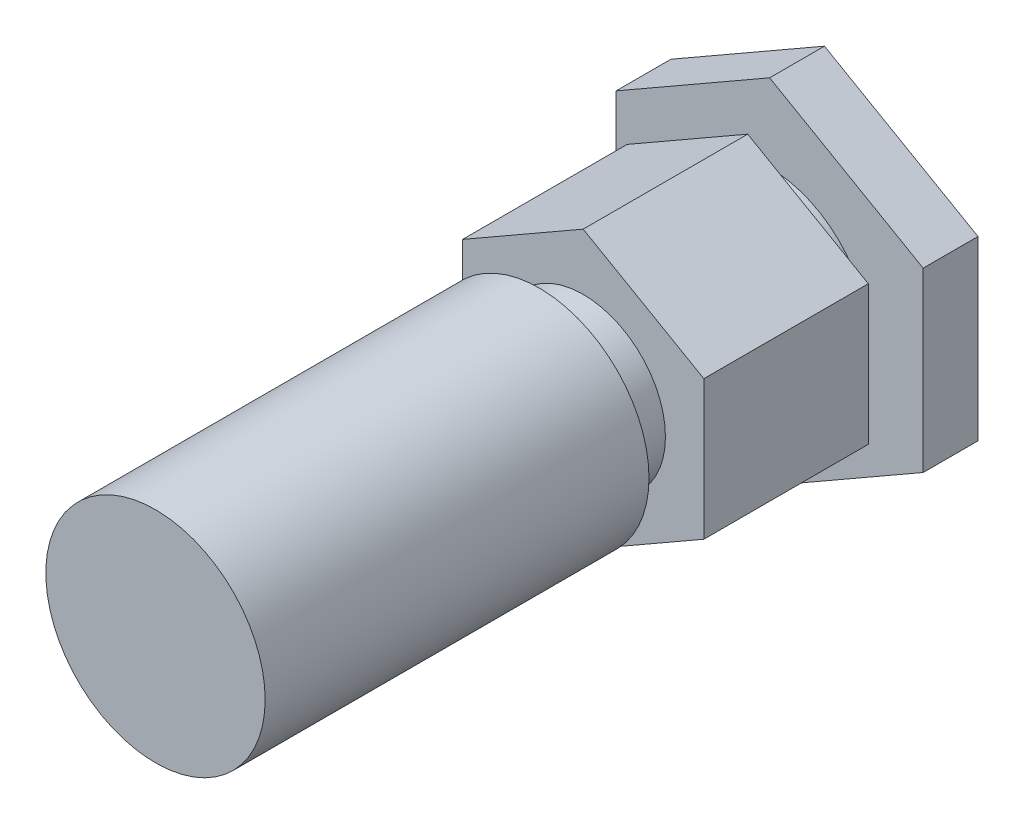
from build123d import *

# Parameters (mm, degrees)
ESQUISSE1_R        = 8
EXTRUSION1_DEPTH   = 5
EXTRUSION2_START   = -2
ESQUISSE2_R        = 9
EXTRUSION2_DEPTH   = 9
EXTRUSION3_DEPTH   = 15
ESQUISSE4_R        = 7.5
ESQUISSE4_R_2      = 6.5
EXTRU_MINCE1_DEPTH = 4
ESQUISSE5_R        = 10
EXTRUSION4_DEPTH   = 35


with BuildPart() as part:
    # Esquisse1 → Extrusion1 (new body)
    with BuildSketch(Plane.XY):
        Polygon((0, 16.1), (14, 8.069768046), (14, -8.069768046), (0, -16.1), (-14, -8.069768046), (-14, 8.069768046), align=None)
        Circle(ESQUISSE1_R, mode=Mode.SUBTRACT)
    extrude(amount=EXTRUSION1_DEPTH)

    # Esquisse2 → Extrusion2 (add)
    with BuildSketch(Plane.XY.offset(EXTRUSION2_START)):
        Circle(ESQUISSE2_R)
    extrude(amount=EXTRUSION2_DEPTH)

    # Esquisse3 → Extrusion3 (add)
    with BuildSketch(Plane.XY.offset(7)):
        Polygon((0, 12.65), (11, 6.340532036), (11, -6.340532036), (0, -12.65), (-11, -6.340532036), (-11, 6.340532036), align=None)
    extrude(amount=EXTRUSION3_DEPTH)

    # Esquisse4 → Extru.-Mince1 (add)
    with BuildSketch(Plane.XY.offset(22)):
        Circle(ESQUISSE4_R)
        Circle(ESQUISSE4_R_2, mode=Mode.SUBTRACT)
    extrude(amount=EXTRU_MINCE1_DEPTH)

    # Esquisse5 → Extrusion4 (add)
    with BuildSketch(Plane.XY.offset(26)):
        Circle(ESQUISSE5_R)
    extrude(amount=EXTRUSION4_DEPTH)


solid = part.part
